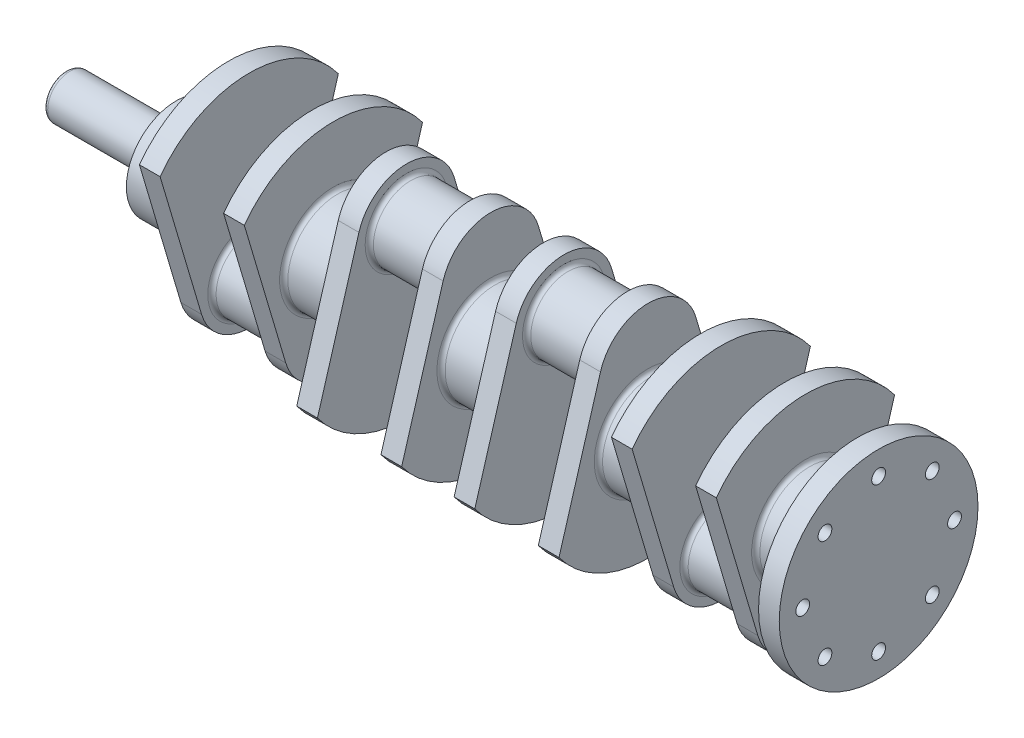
from build123d import *
from build123d.topology import SkipClean

# Parameters (mm, degrees)
SKETCH3_R             = 36
BOSS_EXTRUDE2_DEPTH   = 19
BOSS_EXTRUDE3_DEPTH   = 15
SKETCH5_R             = 27
BOSS_EXTRUDE4_DEPTH   = 23
BODY_MOVE_COPY1_ANGLE = 180
SKETCH8_R             = 36
BOSS_EXTRUDE5_DEPTH   = 19
SKETCH9_R             = 36
BOSS_EXTRUDE6_DEPTH   = 19
SKETCH10_R            = 16
BOSS_EXTRUDE7_DEPTH   = 80
SKETCH11_R            = 72
BOSS_EXTRUDE8_DEPTH   = 15
CUT_EXTRUDE1_REACH    = 600.753
SKETCH12_R            = 5
FILLET1_R             = 3


with BuildPart() as part:
    # Sketch3 → Boss-Extrude2 (new body)
    with BuildSketch(Plane(origin=(0, 0, 0), x_dir=(0, 0, -1), z_dir=(1, 0, 0))):
        Circle(SKETCH3_R)
    extrude(amount=BOSS_EXTRUDE2_DEPTH)

    # Sketch4 → Boss-Extrude3 (add)
    with BuildSketch(Plane(origin=(19, 0, 0), x_dir=(0, 0, -1), z_dir=(1, 0, 0))):
        with BuildLine():
            Line((-34.517510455, -54.224552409), (-64.569893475, 47.23059238))
            ThreePointArc((-64.569893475, 47.23059238), (0, 80), (64.569893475, 47.23059238))
            Line((64.569893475, 47.23059238), (34.517510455, -54.224552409))
            ThreePointArc((34.517510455, -54.224552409), (0, -80), (-34.517510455, -54.224552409))
        make_face()
    extrude(amount=BOSS_EXTRUDE3_DEPTH)

    # Sketch5 → Boss-Extrude4 (add)
    with BuildSketch(Plane(origin=(34, 0, 0), x_dir=(0, 0, -1), z_dir=(1, 0, 0))):
        with Locations(Location((0, -44, 0), (0, 0, 180))):
            Circle(SKETCH5_R)
    extrude(amount=BOSS_EXTRUDE4_DEPTH)

    # Mirror3: part across plane


with BuildPart() as part_1:
    add(part.part)
    add(part.part.mirror(Plane(origin=(57, 0, 0), x_dir=(0, 0, 1), z_dir=(1, 0, 0))))


with BuildPart() as body_2:
    # Mirror4: mirrored copy
    add(part_1.part.mirror(Plane.ZY.offset(-114)))


with BuildPart() as body_2_1:
    # Body-Move_Copy1: moved
    add(body_2.part.rotate(Axis((0, 0, 0), (1, 0, 0)), BODY_MOVE_COPY1_ANGLE))


with BuildPart() as body_3:
    # Mirror6: mirrored copy
    add(part_1.part.mirror(Plane.ZY.offset(-228)))

    # Sketch9 → Boss-Extrude6 (add)
    with BuildSketch(Plane(origin=(456, 0, 0), x_dir=(0, 0, -1), z_dir=(1, 0, 0))):
        Circle(SKETCH9_R)
    extrude(amount=BOSS_EXTRUDE6_DEPTH)


with BuildPart() as body_4:
    # Mirror6 2: mirrored copy
    add(body_2_1.part.mirror(Plane.ZY.offset(-228)))


with BuildPart() as part_2:
    add(part_1.part)

    # Sketch8 → Boss-Extrude5 (add)
    with BuildSketch(Plane.ZY):
        with Locations(Location((0, 0, 0), (0, 0, 180))):
            Circle(SKETCH8_R)
    extrude(amount=BOSS_EXTRUDE5_DEPTH)

    # Combine1: union body 2, body 4, body 3
    add(body_2_1.part)
    add(body_4.part)
    add(body_3.part)

    # Sketch10 → Boss-Extrude7 (add)
    with SkipClean():  # the faces are left unmerged after this step: merging them gives an invalid solid
        with BuildSketch(Plane.ZY.offset(19)):
            Circle(SKETCH10_R)
        extrude(amount=BOSS_EXTRUDE7_DEPTH)

    # Sketch11 → Boss-Extrude8 (add)
    with BuildSketch(Plane(origin=(475, 0, 0), x_dir=(0, 0, -1), z_dir=(1, 0, 0))):
        Circle(SKETCH11_R)
    extrude(amount=BOSS_EXTRUDE8_DEPTH)

    # Sketch12 → Cut-Extrude1 (cut, up to next)
    with BuildSketch(Plane(origin=(490, 0, 0), x_dir=(0, 0, -1), z_dir=(1, 0, 0)), mode=Mode.PRIVATE) as cut_extrude1_sk1:
        with Locations((0, 55)):
            Circle(SKETCH12_R)
    cut_extrude1_tool1 = extrude(cut_extrude1_sk1.sketch, amount=-CUT_EXTRUDE1_REACH, mode=Mode.PRIVATE) & part_2.part
    # Sketch12 → Cut-Extrude1 (cut, up to next)
    with BuildSketch(Plane(origin=(490, 0, 0), x_dir=(0, 0, -1), z_dir=(1, 0, 0)), mode=Mode.PRIVATE) as cut_extrude1_sk2:
        with Locations((38.890872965, 38.890872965)):
            Circle(SKETCH12_R)
    cut_extrude1_tool2 = extrude(cut_extrude1_sk2.sketch, amount=-CUT_EXTRUDE1_REACH, mode=Mode.PRIVATE) & part_2.part
    # Sketch12 → Cut-Extrude1 (cut, up to next)
    with BuildSketch(Plane(origin=(490, 0, 0), x_dir=(0, 0, -1), z_dir=(1, 0, 0)), mode=Mode.PRIVATE) as cut_extrude1_sk3:
        with Locations((55, 0)):
            Circle(SKETCH12_R)
    cut_extrude1_tool3 = extrude(cut_extrude1_sk3.sketch, amount=-CUT_EXTRUDE1_REACH, mode=Mode.PRIVATE) & part_2.part
    # Sketch12 → Cut-Extrude1 (cut, up to next)
    with BuildSketch(Plane(origin=(490, 0, 0), x_dir=(0, 0, -1), z_dir=(1, 0, 0)), mode=Mode.PRIVATE) as cut_extrude1_sk4:
        with Locations((38.890872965, -38.890872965)):
            Circle(SKETCH12_R)
    cut_extrude1_tool4 = extrude(cut_extrude1_sk4.sketch, amount=-CUT_EXTRUDE1_REACH, mode=Mode.PRIVATE) & part_2.part
    # Sketch12 → Cut-Extrude1 (cut, up to next)
    with BuildSketch(Plane(origin=(490, 0, 0), x_dir=(0, 0, -1), z_dir=(1, 0, 0)), mode=Mode.PRIVATE) as cut_extrude1_sk5:
        with Locations((0, -55)):
            Circle(SKETCH12_R)
    cut_extrude1_tool5 = extrude(cut_extrude1_sk5.sketch, amount=-CUT_EXTRUDE1_REACH, mode=Mode.PRIVATE) & part_2.part
    # Sketch12 → Cut-Extrude1 (cut, up to next)
    with BuildSketch(Plane(origin=(490, 0, 0), x_dir=(0, 0, -1), z_dir=(1, 0, 0)), mode=Mode.PRIVATE) as cut_extrude1_sk6:
        with Locations((-38.890872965, -38.890872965)):
            Circle(SKETCH12_R)
    cut_extrude1_tool6 = extrude(cut_extrude1_sk6.sketch, amount=-CUT_EXTRUDE1_REACH, mode=Mode.PRIVATE) & part_2.part
    # Sketch12 → Cut-Extrude1 (cut, up to next)
    with BuildSketch(Plane(origin=(490, 0, 0), x_dir=(0, 0, -1), z_dir=(1, 0, 0)), mode=Mode.PRIVATE) as cut_extrude1_sk7:
        with Locations((-55, 0)):
            Circle(SKETCH12_R)
    cut_extrude1_tool7 = extrude(cut_extrude1_sk7.sketch, amount=-CUT_EXTRUDE1_REACH, mode=Mode.PRIVATE) & part_2.part
    # Sketch12 → Cut-Extrude1 (cut, up to next)
    with BuildSketch(Plane(origin=(490, 0, 0), x_dir=(0, 0, -1), z_dir=(1, 0, 0)), mode=Mode.PRIVATE) as cut_extrude1_sk8:
        with Locations((-38.890872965, 38.890872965)):
            Circle(SKETCH12_R)
    cut_extrude1_tool8 = extrude(cut_extrude1_sk8.sketch, amount=-CUT_EXTRUDE1_REACH, mode=Mode.PRIVATE) & part_2.part
    add(cut_extrude1_tool1.solids().sort_by_distance((490, 55, 0))[0], mode=Mode.SUBTRACT)
    add(cut_extrude1_tool2.solids().sort_by_distance((490, 38.890873, -38.890873))[0], mode=Mode.SUBTRACT)
    add(cut_extrude1_tool3.solids().sort_by_distance((490, 0, -55))[0], mode=Mode.SUBTRACT)
    add(cut_extrude1_tool4.solids().sort_by_distance((490, -38.890873, -38.890873))[0], mode=Mode.SUBTRACT)
    add(cut_extrude1_tool5.solids().sort_by_distance((490, -55, 0))[0], mode=Mode.SUBTRACT)
    add(cut_extrude1_tool6.solids().sort_by_distance((490, -38.890873, 38.890873))[0], mode=Mode.SUBTRACT)
    add(cut_extrude1_tool7.solids().sort_by_distance((490, 0, 55))[0], mode=Mode.SUBTRACT)
    add(cut_extrude1_tool8.solids().sort_by_distance((490, 38.890873, 38.890873))[0], mode=Mode.SUBTRACT)

    # Fillet1
    fillet1_edges = [part_2.edges().sort_by_distance(p)[0] for p in [
        (-19, 0, -16),
        (-99, 0, -16),
        (34, -44, -27),
        (95, 0, 36),
        (80, -44, -27),
        (19, 0, 36),
        (209, 0, -36),
        (194, 44, 27),
        (148, 44, 27),
        (133, 0, -36),
        (247, 0, -36),
        (262, 44, 27),
        (323, 0, -36),
        (308, 44, 27),
        (437, 0, 36),
        (422, -44, -27),
        (376, -44, -27),
        (361, 0, 36),
        (475, 0, 36),
    ]]
    fillet(fillet1_edges, radius=FILLET1_R)


solid = part_2.part
